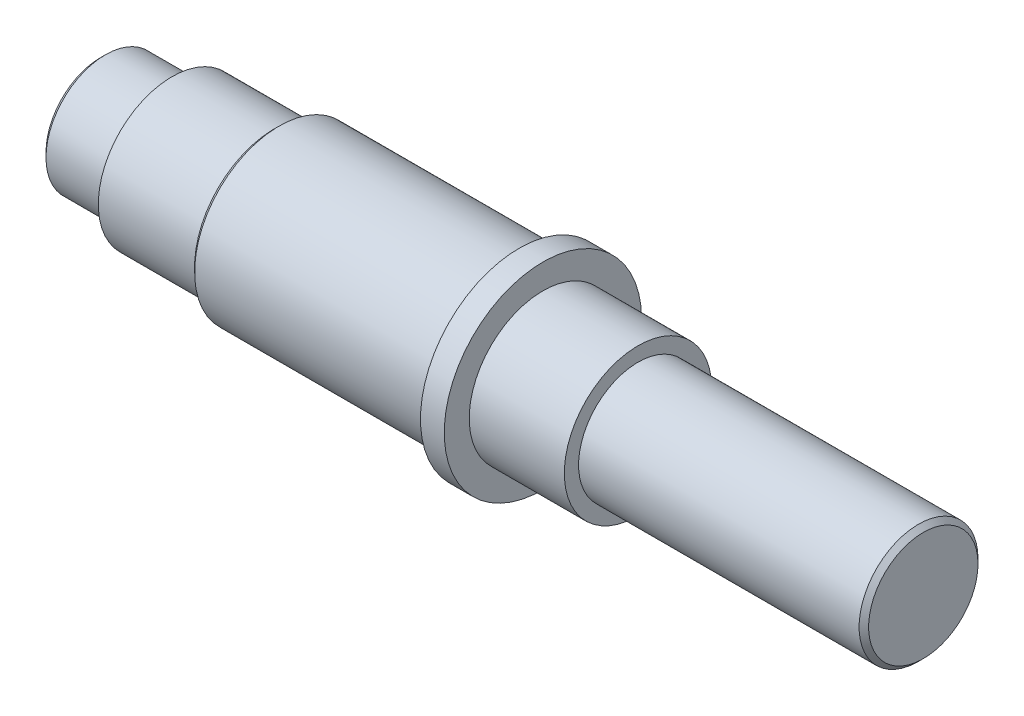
ISO-10303-21;
HEADER;
FILE_DESCRIPTION(('STEP AP214'),'2;1');
FILE_NAME('part.step','',(''),(''),'','','');
FILE_SCHEMA(('AUTOMOTIVE_DESIGN { 1 0 10303 214 1 1 1 1 }'));
ENDSEC;
DATA;
#1=APPLICATION_CONTEXT('core data for automotive mechanical design processes');
#2=APPLICATION_PROTOCOL_DEFINITION('international standard','automotive_design',2000,#1);
#3=PRODUCT_CONTEXT('',#1,'mechanical');
#4=PRODUCT('Part','Part','',(#3));
#5=PRODUCT_RELATED_PRODUCT_CATEGORY('part','',(#4));
#6=PRODUCT_DEFINITION_FORMATION('','',#4);
#7=PRODUCT_DEFINITION_CONTEXT('part definition',#1,'design');
#8=PRODUCT_DEFINITION('design','',#6,#7);
#9=PRODUCT_DEFINITION_SHAPE('','',#8);
#10=(LENGTH_UNIT() NAMED_UNIT(*) SI_UNIT(.MILLI.,.METRE.));
#11=(NAMED_UNIT(*) PLANE_ANGLE_UNIT() SI_UNIT($,.RADIAN.));
#12=(NAMED_UNIT(*) SI_UNIT($,.STERADIAN.) SOLID_ANGLE_UNIT());
#13=UNCERTAINTY_MEASURE_WITH_UNIT(LENGTH_MEASURE(1.E-05),#10,'distance_accuracy_value','');
#14=(GEOMETRIC_REPRESENTATION_CONTEXT(3) GLOBAL_UNCERTAINTY_ASSIGNED_CONTEXT((#13)) GLOBAL_UNIT_ASSIGNED_CONTEXT((#10,
#11,#12)) REPRESENTATION_CONTEXT('',''));
#15=CARTESIAN_POINT('',(0.,0.,0.));
#16=DIRECTION('',(0.,0.,1.));
#17=DIRECTION('',(1.,0.,0.));
#18=AXIS2_PLACEMENT_3D('',#15,#16,#17);
#19=CARTESIAN_POINT('',(-28.25,0.,0.));
#20=DIRECTION('',(1.,0.,0.));
#21=DIRECTION('',(0.,0.,-1.));
#22=AXIS2_PLACEMENT_3D('',#19,#20,#21);
#23=PLANE('',#22);
#24=CARTESIAN_POINT('',(-28.25,0.,0.));
#25=DIRECTION('',(1.,0.,0.));
#26=DIRECTION('',(0.,0.,-1.));
#27=AXIS2_PLACEMENT_3D('',#24,#25,#26);
#28=CIRCLE('',#27,16.75);
#29=CARTESIAN_POINT('',(-28.25,0.,-16.75));
#30=VERTEX_POINT('',#29);
#31=EDGE_CURVE('E10',#30,#30,#28,.F.);
#32=ORIENTED_EDGE('',*,*,#31,.T.);
#33=EDGE_LOOP('',(#32));
#34=FACE_BOUND('',#33,.T.);
#35=CARTESIAN_POINT('',(-28.25,0.,0.));
#36=DIRECTION('',(1.,0.,0.));
#37=DIRECTION('',(0.,0.,-1.));
#38=AXIS2_PLACEMENT_3D('',#35,#36,#37);
#39=CIRCLE('',#38,15.5);
#40=CARTESIAN_POINT('',(-28.25,0.,-15.5));
#41=VERTEX_POINT('',#40);
#42=EDGE_CURVE('E65',#41,#41,#39,.T.);
#43=ORIENTED_EDGE('',*,*,#42,.T.);
#44=EDGE_LOOP('',(#43));
#45=FACE_BOUND('',#44,.T.);
#46=ADVANCED_FACE('F38',(#34,#45),#23,.F.);
#47=CARTESIAN_POINT('',(200.,0.,0.));
#48=DIRECTION('',(1.,0.,0.));
#49=DIRECTION('',(0.,0.,-1.));
#50=AXIS2_PLACEMENT_3D('',#47,#48,#49);
#51=CYLINDRICAL_SURFACE('',#50,15.5);
#52=CARTESIAN_POINT('',(-49.75,0.,0.));
#53=DIRECTION('',(1.,0.,0.));
#54=DIRECTION('',(0.,0.,-1.));
#55=AXIS2_PLACEMENT_3D('',#52,#53,#54);
#56=CIRCLE('',#55,15.5);
#57=CARTESIAN_POINT('',(-49.75,0.,-15.5));
#58=VERTEX_POINT('',#57);
#59=EDGE_CURVE('E68',#58,#58,#56,.T.);
#60=ORIENTED_EDGE('',*,*,#59,.T.);
#61=EDGE_LOOP('',(#60));
#62=FACE_BOUND('',#61,.T.);
#63=ORIENTED_EDGE('',*,*,#42,.F.);
#64=EDGE_LOOP('',(#63));
#65=FACE_BOUND('',#64,.T.);
#66=ADVANCED_FACE('F110',(#62,#65),#51,.T.);
#67=CARTESIAN_POINT('',(-49.75,0.,0.));
#68=DIRECTION('',(-1.,0.,0.));
#69=DIRECTION('',(0.,0.,1.));
#70=AXIS2_PLACEMENT_3D('',#67,#68,#69);
#71=PLANE('',#70);
#72=CARTESIAN_POINT('',(-49.75,0.,0.));
#73=DIRECTION('',(1.,0.,0.));
#74=DIRECTION('',(0.,0.,-1.));
#75=AXIS2_PLACEMENT_3D('',#72,#73,#74);
#76=CIRCLE('',#75,12.5);
#77=CARTESIAN_POINT('',(-49.75,0.,-12.5));
#78=VERTEX_POINT('',#77);
#79=EDGE_CURVE('E71',#78,#78,#76,.T.);
#80=ORIENTED_EDGE('',*,*,#79,.T.);
#81=EDGE_LOOP('',(#80));
#82=FACE_BOUND('',#81,.T.);
#83=ORIENTED_EDGE('',*,*,#59,.F.);
#84=EDGE_LOOP('',(#83));
#85=FACE_BOUND('',#84,.T.);
#86=ADVANCED_FACE('F115',(#82,#85),#71,.T.);
#87=CARTESIAN_POINT('',(200.,0.,0.));
#88=DIRECTION('',(1.,0.,0.));
#89=DIRECTION('',(0.,0.,-1.));
#90=AXIS2_PLACEMENT_3D('',#87,#88,#89);
#91=CYLINDRICAL_SURFACE('',#90,12.5);
#92=CARTESIAN_POINT('',(-63.75,0.,0.));
#93=DIRECTION('',(-1.,0.,0.));
#94=DIRECTION('',(0.,0.,1.));
#95=AXIS2_PLACEMENT_3D('',#92,#93,#94);
#96=CIRCLE('',#95,12.5);
#97=CARTESIAN_POINT('',(-63.75,0.,12.5));
#98=VERTEX_POINT('',#97);
#99=EDGE_CURVE('E54',#98,#98,#96,.F.);
#100=ORIENTED_EDGE('',*,*,#99,.T.);
#101=EDGE_LOOP('',(#100));
#102=FACE_BOUND('',#101,.T.);
#103=ORIENTED_EDGE('',*,*,#79,.F.);
#104=EDGE_LOOP('',(#103));
#105=FACE_BOUND('',#104,.T.);
#106=ADVANCED_FACE('F136',(#102,#105),#91,.T.);
#107=CARTESIAN_POINT('',(-64.75,0.,0.));
#108=DIRECTION('',(-1.,0.,0.));
#109=DIRECTION('',(0.,0.,1.));
#110=AXIS2_PLACEMENT_3D('',#107,#108,#109);
#111=PLANE('',#110);
#112=CARTESIAN_POINT('',(-64.75,0.,0.));
#113=DIRECTION('',(-1.,0.,0.));
#114=DIRECTION('',(0.,0.,1.));
#115=AXIS2_PLACEMENT_3D('',#112,#113,#114);
#116=CIRCLE('',#115,11.5000000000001);
#117=CARTESIAN_POINT('',(-64.75,0.,11.5000000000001));
#118=VERTEX_POINT('',#117);
#119=EDGE_CURVE('E50',#118,#118,#116,.T.);
#120=ORIENTED_EDGE('',*,*,#119,.T.);
#121=EDGE_LOOP('',(#120));
#122=FACE_BOUND('',#121,.T.);
#123=ADVANCED_FACE('F139',(#122),#111,.T.);
#124=CARTESIAN_POINT('',(108.25,0.,0.));
#125=DIRECTION('',(1.,0.,0.));
#126=DIRECTION('',(0.,0.,-1.));
#127=AXIS2_PLACEMENT_3D('',#124,#125,#126);
#128=PLANE('',#127);
#129=CARTESIAN_POINT('',(108.25,0.,0.));
#130=DIRECTION('',(1.,0.,0.));
#131=DIRECTION('',(0.,0.,-1.));
#132=AXIS2_PLACEMENT_3D('',#129,#130,#131);
#133=CIRCLE('',#132,11.5);
#134=CARTESIAN_POINT('',(108.25,0.,-11.5));
#135=VERTEX_POINT('',#134);
#136=EDGE_CURVE('E62',#135,#135,#133,.T.);
#137=ORIENTED_EDGE('',*,*,#136,.T.);
#138=EDGE_LOOP('',(#137));
#139=FACE_BOUND('',#138,.T.);
#140=ADVANCED_FACE('F153',(#139),#128,.T.);
#141=CARTESIAN_POINT('',(200.,0.,0.));
#142=DIRECTION('',(1.,0.,0.));
#143=DIRECTION('',(0.,0.,-1.));
#144=AXIS2_PLACEMENT_3D('',#141,#142,#143);
#145=CYLINDRICAL_SURFACE('',#144,12.5);
#146=CARTESIAN_POINT('',(107.25,0.,0.));
#147=DIRECTION('',(1.,0.,0.));
#148=DIRECTION('',(0.,0.,-1.));
#149=AXIS2_PLACEMENT_3D('',#146,#147,#148);
#150=CIRCLE('',#149,12.5);
#151=CARTESIAN_POINT('',(107.25,0.,-12.5));
#152=VERTEX_POINT('',#151);
#153=EDGE_CURVE('E59',#152,#152,#150,.F.);
#154=ORIENTED_EDGE('',*,*,#153,.T.);
#155=EDGE_LOOP('',(#154));
#156=FACE_BOUND('',#155,.T.);
#157=CARTESIAN_POINT('',(48.25,0.,0.));
#158=DIRECTION('',(1.,0.,0.));
#159=DIRECTION('',(0.,0.,-1.));
#160=AXIS2_PLACEMENT_3D('',#157,#158,#159);
#161=CIRCLE('',#160,12.5);
#162=CARTESIAN_POINT('',(48.25,0.,-12.5));
#163=VERTEX_POINT('',#162);
#164=EDGE_CURVE('E74',#163,#163,#161,.T.);
#165=ORIENTED_EDGE('',*,*,#164,.T.);
#166=EDGE_LOOP('',(#165));
#167=FACE_BOUND('',#166,.T.);
#168=ADVANCED_FACE('F157',(#156,#167),#145,.T.);
#169=CARTESIAN_POINT('',(48.25,0.,0.));
#170=DIRECTION('',(-1.,0.,0.));
#171=DIRECTION('',(0.,0.,1.));
#172=AXIS2_PLACEMENT_3D('',#169,#170,#171);
#173=PLANE('',#172);
#174=ORIENTED_EDGE('',*,*,#164,.F.);
#175=EDGE_LOOP('',(#174));
#176=FACE_BOUND('',#175,.T.);
#177=CARTESIAN_POINT('',(48.25,0.,0.));
#178=DIRECTION('',(1.,0.,0.));
#179=DIRECTION('',(0.,0.,-1.));
#180=AXIS2_PLACEMENT_3D('',#177,#178,#179);
#181=CIRCLE('',#180,15.5);
#182=CARTESIAN_POINT('',(48.25,0.,-15.5));
#183=VERTEX_POINT('',#182);
#184=EDGE_CURVE('E77',#183,#183,#181,.T.);
#185=ORIENTED_EDGE('',*,*,#184,.T.);
#186=EDGE_LOOP('',(#185));
#187=FACE_BOUND('',#186,.T.);
#188=ADVANCED_FACE('F161',(#176,#187),#173,.F.);
#189=CARTESIAN_POINT('',(200.,0.,0.));
#190=DIRECTION('',(1.,0.,0.));
#191=DIRECTION('',(0.,0.,-1.));
#192=AXIS2_PLACEMENT_3D('',#189,#190,#191);
#193=CYLINDRICAL_SURFACE('',#192,15.5);
#194=CARTESIAN_POINT('',(28.25,0.,0.));
#195=DIRECTION('',(1.,0.,0.));
#196=DIRECTION('',(0.,0.,-1.));
#197=AXIS2_PLACEMENT_3D('',#194,#195,#196);
#198=CIRCLE('',#197,15.5);
#199=CARTESIAN_POINT('',(28.25,0.,-15.5));
#200=VERTEX_POINT('',#199);
#201=EDGE_CURVE('E80',#200,#200,#198,.T.);
#202=ORIENTED_EDGE('',*,*,#201,.T.);
#203=EDGE_LOOP('',(#202));
#204=FACE_BOUND('',#203,.T.);
#205=ORIENTED_EDGE('',*,*,#184,.F.);
#206=EDGE_LOOP('',(#205));
#207=FACE_BOUND('',#206,.T.);
#208=ADVANCED_FACE('F165',(#204,#207),#193,.T.);
#209=CARTESIAN_POINT('',(28.25,0.,0.));
#210=DIRECTION('',(1.,0.,0.));
#211=DIRECTION('',(0.,0.,-1.));
#212=AXIS2_PLACEMENT_3D('',#209,#210,#211);
#213=PLANE('',#212);
#214=CARTESIAN_POINT('',(28.25,0.,0.));
#215=DIRECTION('',(1.,0.,0.));
#216=DIRECTION('',(0.,0.,-1.));
#217=AXIS2_PLACEMENT_3D('',#214,#215,#216);
#218=CIRCLE('',#217,20.75);
#219=CARTESIAN_POINT('',(28.25,0.,-20.75));
#220=VERTEX_POINT('',#219);
#221=EDGE_CURVE('E83',#220,#220,#218,.T.);
#222=ORIENTED_EDGE('',*,*,#221,.T.);
#223=EDGE_LOOP('',(#222));
#224=FACE_BOUND('',#223,.T.);
#225=ORIENTED_EDGE('',*,*,#201,.F.);
#226=EDGE_LOOP('',(#225));
#227=FACE_BOUND('',#226,.T.);
#228=ADVANCED_FACE('F169',(#224,#227),#213,.T.);
#229=CARTESIAN_POINT('',(200.,0.,0.));
#230=DIRECTION('',(1.,0.,0.));
#231=DIRECTION('',(0.,0.,-1.));
#232=AXIS2_PLACEMENT_3D('',#229,#230,#231);
#233=CYLINDRICAL_SURFACE('',#232,20.75);
#234=CARTESIAN_POINT('',(23.25,0.,0.));
#235=DIRECTION('',(1.,0.,0.));
#236=DIRECTION('',(0.,0.,-1.));
#237=AXIS2_PLACEMENT_3D('',#234,#235,#236);
#238=CIRCLE('',#237,20.75);
#239=CARTESIAN_POINT('',(23.25,0.,-20.75));
#240=VERTEX_POINT('',#239);
#241=EDGE_CURVE('E86',#240,#240,#238,.T.);
#242=ORIENTED_EDGE('',*,*,#241,.T.);
#243=EDGE_LOOP('',(#242));
#244=FACE_BOUND('',#243,.T.);
#245=ORIENTED_EDGE('',*,*,#221,.F.);
#246=EDGE_LOOP('',(#245));
#247=FACE_BOUND('',#246,.T.);
#248=ADVANCED_FACE('F107',(#244,#247),#233,.T.);
#249=CARTESIAN_POINT('',(23.25,0.,0.));
#250=DIRECTION('',(-1.,0.,0.));
#251=DIRECTION('',(0.,0.,1.));
#252=AXIS2_PLACEMENT_3D('',#249,#250,#251);
#253=PLANE('',#252);
#254=CARTESIAN_POINT('',(23.25,0.,0.));
#255=DIRECTION('',(1.,0.,0.));
#256=DIRECTION('',(0.,0.,-1.));
#257=AXIS2_PLACEMENT_3D('',#254,#255,#256);
#258=CIRCLE('',#257,17.75);
#259=CARTESIAN_POINT('',(23.25,0.,-17.75));
#260=VERTEX_POINT('',#259);
#261=EDGE_CURVE('E89',#260,#260,#258,.T.);
#262=ORIENTED_EDGE('',*,*,#261,.T.);
#263=EDGE_LOOP('',(#262));
#264=FACE_BOUND('',#263,.T.);
#265=ORIENTED_EDGE('',*,*,#241,.F.);
#266=EDGE_LOOP('',(#265));
#267=FACE_BOUND('',#266,.T.);
#268=ADVANCED_FACE('F93',(#264,#267),#253,.T.);
#269=CARTESIAN_POINT('',(200.,0.,0.));
#270=DIRECTION('',(1.,0.,0.));
#271=DIRECTION('',(0.,0.,-1.));
#272=AXIS2_PLACEMENT_3D('',#269,#270,#271);
#273=CYLINDRICAL_SURFACE('',#272,17.75);
#274=CARTESIAN_POINT('',(-27.25,0.,0.));
#275=DIRECTION('',(1.,0.,0.));
#276=DIRECTION('',(0.,0.,-1.));
#277=AXIS2_PLACEMENT_3D('',#274,#275,#276);
#278=CIRCLE('',#277,17.75);
#279=CARTESIAN_POINT('',(-27.25,0.,-17.75));
#280=VERTEX_POINT('',#279);
#281=EDGE_CURVE('E46',#280,#280,#278,.T.);
#282=ORIENTED_EDGE('',*,*,#281,.T.);
#283=EDGE_LOOP('',(#282));
#284=FACE_BOUND('',#283,.T.);
#285=ORIENTED_EDGE('',*,*,#261,.F.);
#286=EDGE_LOOP('',(#285));
#287=FACE_BOUND('',#286,.T.);
#288=ADVANCED_FACE('F96',(#284,#287),#273,.T.);
#289=CARTESIAN_POINT('',(108.25,0.,0.));
#290=DIRECTION('',(-1.,0.,0.));
#291=DIRECTION('',(0.,0.,1.));
#292=AXIS2_PLACEMENT_3D('',#289,#290,#291);
#293=CONICAL_SURFACE('',#292,11.5,0.785398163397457);
#294=ORIENTED_EDGE('',*,*,#153,.F.);
#295=EDGE_LOOP('',(#294));
#296=FACE_BOUND('',#295,.T.);
#297=ORIENTED_EDGE('',*,*,#136,.F.);
#298=EDGE_LOOP('',(#297));
#299=FACE_BOUND('',#298,.T.);
#300=ADVANCED_FACE('F98',(#296,#299),#293,.T.);
#301=CARTESIAN_POINT('',(-63.75,0.,0.));
#302=DIRECTION('',(1.,0.,0.));
#303=DIRECTION('',(0.,0.,-1.));
#304=AXIS2_PLACEMENT_3D('',#301,#302,#303);
#305=CONICAL_SURFACE('',#304,12.5,0.785398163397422);
#306=ORIENTED_EDGE('',*,*,#119,.F.);
#307=EDGE_LOOP('',(#306));
#308=FACE_BOUND('',#307,.T.);
#309=ORIENTED_EDGE('',*,*,#99,.F.);
#310=EDGE_LOOP('',(#309));
#311=FACE_BOUND('',#310,.T.);
#312=ADVANCED_FACE('F104',(#308,#311),#305,.T.);
#313=CARTESIAN_POINT('',(-27.25,0.,0.));
#314=DIRECTION('',(1.,0.,0.));
#315=DIRECTION('',(0.,0.,-1.));
#316=AXIS2_PLACEMENT_3D('',#313,#314,#315);
#317=CONICAL_SURFACE('',#316,17.75,0.785398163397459);
#318=ORIENTED_EDGE('',*,*,#31,.F.);
#319=EDGE_LOOP('',(#318));
#320=FACE_BOUND('',#319,.T.);
#321=ORIENTED_EDGE('',*,*,#281,.F.);
#322=EDGE_LOOP('',(#321));
#323=FACE_BOUND('',#322,.T.);
#324=ADVANCED_FACE('F41',(#320,#323),#317,.T.);
#325=CLOSED_SHELL('',(#46,#66,#86,#106,#123,#140,#168,#188,#208,#228,#248,#268,#288,#300,#312,#324));
#326=MANIFOLD_SOLID_BREP('B2',#325);
#327=ADVANCED_BREP_SHAPE_REPRESENTATION('',(#18,#326),#14);
#328=SHAPE_DEFINITION_REPRESENTATION(#9,#327);
ENDSEC;
END-ISO-10303-21;
